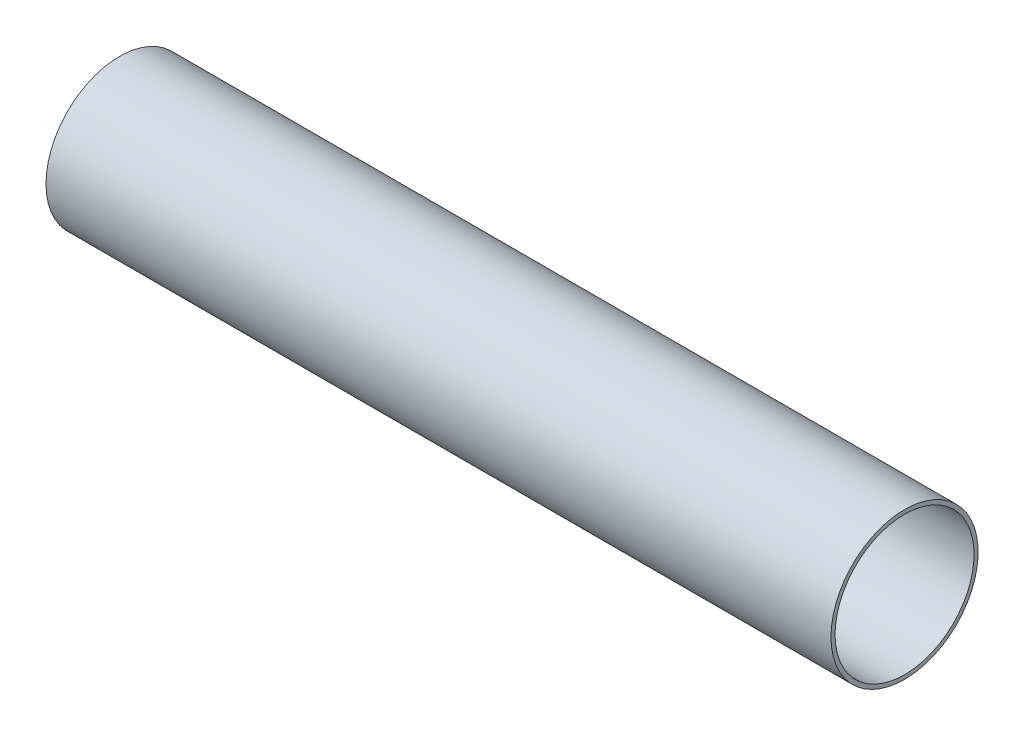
from build123d import *

# Parameters (mm, degrees)
SKETCH1_R      = 28.575
SKETCH1_R_2    = 26.9875
EXTRUDE1_DEPTH = 304.8


with BuildPart() as part:
    # Sketch1 → Extrude1 (new body)
    with BuildSketch(Plane(origin=(0, 0, 0), x_dir=(0, 0, -1), z_dir=(1, 0, 0))):
        with Locations(Location((0, 0, 0), (0, 0, 180))):
            Circle(SKETCH1_R)
        with Locations(Location((0, 0, 0), (0, 0, 180))):
            Circle(SKETCH1_R_2, mode=Mode.SUBTRACT)
    extrude(amount=EXTRUDE1_DEPTH)


solid = part.part
